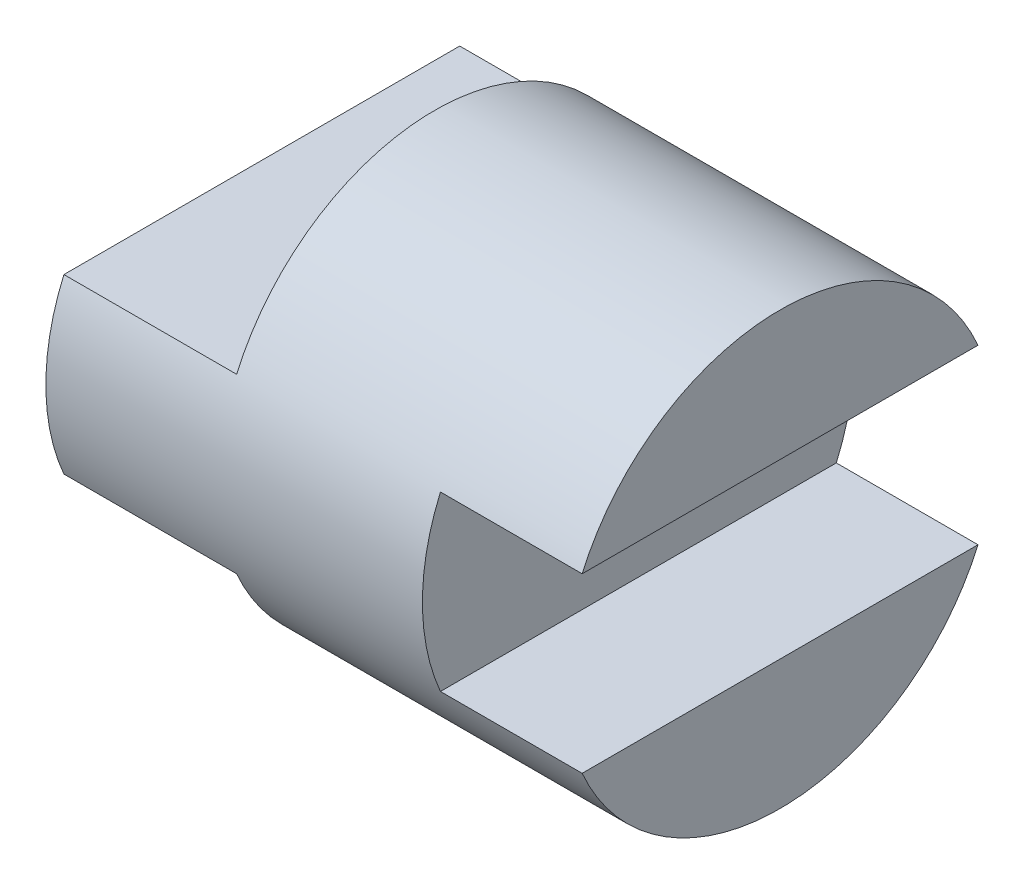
ISO-10303-21;
HEADER;
FILE_DESCRIPTION(('STEP AP214'),'2;1');
FILE_NAME('part.step','',(''),(''),'','','');
FILE_SCHEMA(('AUTOMOTIVE_DESIGN { 1 0 10303 214 1 1 1 1 }'));
ENDSEC;
DATA;
#1=APPLICATION_CONTEXT('core data for automotive mechanical design processes');
#2=APPLICATION_PROTOCOL_DEFINITION('international standard','automotive_design',2000,#1);
#3=PRODUCT_CONTEXT('',#1,'mechanical');
#4=PRODUCT('Part','Part','',(#3));
#5=PRODUCT_RELATED_PRODUCT_CATEGORY('part','',(#4));
#6=PRODUCT_DEFINITION_FORMATION('','',#4);
#7=PRODUCT_DEFINITION_CONTEXT('part definition',#1,'design');
#8=PRODUCT_DEFINITION('design','',#6,#7);
#9=PRODUCT_DEFINITION_SHAPE('','',#8);
#10=(LENGTH_UNIT() NAMED_UNIT(*) SI_UNIT(.MILLI.,.METRE.));
#11=(NAMED_UNIT(*) PLANE_ANGLE_UNIT() SI_UNIT($,.RADIAN.));
#12=(NAMED_UNIT(*) SI_UNIT($,.STERADIAN.) SOLID_ANGLE_UNIT());
#13=UNCERTAINTY_MEASURE_WITH_UNIT(LENGTH_MEASURE(1.E-05),#10,'distance_accuracy_value','');
#14=(GEOMETRIC_REPRESENTATION_CONTEXT(3) GLOBAL_UNCERTAINTY_ASSIGNED_CONTEXT((#13)) GLOBAL_UNIT_ASSIGNED_CONTEXT((#10,
#11,#12)) REPRESENTATION_CONTEXT('',''));
#15=CARTESIAN_POINT('',(0.,0.,0.));
#16=DIRECTION('',(0.,0.,1.));
#17=DIRECTION('',(1.,0.,0.));
#18=AXIS2_PLACEMENT_3D('',#15,#16,#17);
#19=CARTESIAN_POINT('',(120.,0.,0.));
#20=DIRECTION('',(1.,0.,0.));
#21=DIRECTION('',(0.,0.,-1.));
#22=AXIS2_PLACEMENT_3D('',#19,#20,#21);
#23=PLANE('',#22);
#24=DIRECTION('',(0.,0.,-1.));
#25=VECTOR('',#24,1.);
#26=CARTESIAN_POINT('',(120.,-20.,0.));
#27=LINE('',#26,#25);
#28=CARTESIAN_POINT('',(120.,-20.,45.8257569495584));
#29=VERTEX_POINT('',#28);
#30=CARTESIAN_POINT('',(120.,-20.,-45.8257569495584));
#31=VERTEX_POINT('',#30);
#32=EDGE_CURVE('E154',#29,#31,#27,.T.);
#33=ORIENTED_EDGE('',*,*,#32,.F.);
#34=CARTESIAN_POINT('',(120.,0.,0.));
#35=DIRECTION('',(1.,0.,0.));
#36=DIRECTION('',(0.,0.,-1.));
#37=AXIS2_PLACEMENT_3D('',#34,#35,#36);
#38=CIRCLE('',#37,50.);
#39=EDGE_CURVE('E138',#29,#31,#38,.T.);
#40=ORIENTED_EDGE('',*,*,#39,.T.);
#41=EDGE_LOOP('',(#33,#40));
#42=FACE_BOUND('',#41,.T.);
#43=ADVANCED_FACE('F31',(#42),#23,.T.);
#44=CARTESIAN_POINT('',(120.,0.,0.));
#45=DIRECTION('',(-1.,0.,0.));
#46=DIRECTION('',(0.,0.,1.));
#47=AXIS2_PLACEMENT_3D('',#44,#45,#46);
#48=CYLINDRICAL_SURFACE('',#47,50.);
#49=DIRECTION('',(-1.,0.,0.));
#50=VECTOR('',#49,1.);
#51=CARTESIAN_POINT('',(120.,20.,-45.8257569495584));
#52=LINE('',#51,#50);
#53=CARTESIAN_POINT('',(120.,20.,-45.8257569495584));
#54=VERTEX_POINT('',#53);
#55=CARTESIAN_POINT('',(87.1908753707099,20.,-45.8257569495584));
#56=VERTEX_POINT('',#55);
#57=EDGE_CURVE('E46',#54,#56,#52,.T.);
#58=ORIENTED_EDGE('',*,*,#57,.T.);
#59=CARTESIAN_POINT('',(87.1908753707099,0.,0.));
#60=DIRECTION('',(-1.,0.,0.));
#61=DIRECTION('',(0.,0.,1.));
#62=AXIS2_PLACEMENT_3D('',#59,#60,#61);
#63=CIRCLE('',#62,50.);
#64=CARTESIAN_POINT('',(87.1908753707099,-20.,-45.8257569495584));
#65=VERTEX_POINT('',#64);
#66=EDGE_CURVE('E11',#56,#65,#63,.T.);
#67=ORIENTED_EDGE('',*,*,#66,.T.);
#68=DIRECTION('',(-1.,0.,0.));
#69=VECTOR('',#68,1.);
#70=CARTESIAN_POINT('',(120.,-20.,-45.8257569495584));
#71=LINE('',#70,#69);
#72=EDGE_CURVE('E113',#65,#31,#71,.F.);
#73=ORIENTED_EDGE('',*,*,#72,.T.);
#74=ORIENTED_EDGE('',*,*,#39,.F.);
#75=DIRECTION('',(-1.,0.,0.));
#76=VECTOR('',#75,1.);
#77=CARTESIAN_POINT('',(120.,-20.,45.8257569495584));
#78=LINE('',#77,#76);
#79=CARTESIAN_POINT('',(87.1908753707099,-20.,45.8257569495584));
#80=VERTEX_POINT('',#79);
#81=EDGE_CURVE('E115',#29,#80,#78,.T.);
#82=ORIENTED_EDGE('',*,*,#81,.T.);
#83=CARTESIAN_POINT('',(87.1908753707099,20.,45.8257569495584));
#84=VERTEX_POINT('',#83);
#85=EDGE_CURVE('E35',#80,#84,#63,.T.);
#86=ORIENTED_EDGE('',*,*,#85,.T.);
#87=DIRECTION('',(-1.,0.,0.));
#88=VECTOR('',#87,1.);
#89=CARTESIAN_POINT('',(120.,20.,45.8257569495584));
#90=LINE('',#89,#88);
#91=CARTESIAN_POINT('',(120.,20.,45.8257569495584));
#92=VERTEX_POINT('',#91);
#93=EDGE_CURVE('E107',#84,#92,#90,.F.);
#94=ORIENTED_EDGE('',*,*,#93,.T.);
#95=EDGE_CURVE('E112',#54,#92,#38,.T.);
#96=ORIENTED_EDGE('',*,*,#95,.F.);
#97=EDGE_LOOP('',(#58,#67,#73,#74,#82,#86,#94,#96));
#98=FACE_BOUND('',#97,.T.);
#99=CARTESIAN_POINT('',(40.,0.,0.));
#100=DIRECTION('',(-1.,0.,0.));
#101=DIRECTION('',(0.,0.,1.));
#102=AXIS2_PLACEMENT_3D('',#99,#100,#101);
#103=CIRCLE('',#102,50.);
#104=CARTESIAN_POINT('',(40.,-20.,-45.8257569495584));
#105=VERTEX_POINT('',#104);
#106=CARTESIAN_POINT('',(40.,-20.,45.8257569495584));
#107=VERTEX_POINT('',#106);
#108=EDGE_CURVE('E151',#105,#107,#103,.T.);
#109=ORIENTED_EDGE('',*,*,#108,.F.);
#110=DIRECTION('',(-1.,0.,0.));
#111=VECTOR('',#110,1.);
#112=CARTESIAN_POINT('',(120.,-20.,-45.8257569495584));
#113=LINE('',#112,#111);
#114=CARTESIAN_POINT('',(0.,-20.,-45.8257569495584));
#115=VERTEX_POINT('',#114);
#116=EDGE_CURVE('E125',#105,#115,#113,.T.);
#117=ORIENTED_EDGE('',*,*,#116,.T.);
#118=CARTESIAN_POINT('',(0.,0.,0.));
#119=DIRECTION('',(1.,0.,0.));
#120=DIRECTION('',(0.,0.,-1.));
#121=AXIS2_PLACEMENT_3D('',#118,#119,#120);
#122=CIRCLE('',#121,50.);
#123=CARTESIAN_POINT('',(0.,20.,-45.8257569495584));
#124=VERTEX_POINT('',#123);
#125=EDGE_CURVE('E137',#115,#124,#122,.T.);
#126=ORIENTED_EDGE('',*,*,#125,.T.);
#127=DIRECTION('',(-1.,0.,0.));
#128=VECTOR('',#127,1.);
#129=CARTESIAN_POINT('',(120.,20.,-45.8257569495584));
#130=LINE('',#129,#128);
#131=CARTESIAN_POINT('',(40.,20.,-45.8257569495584));
#132=VERTEX_POINT('',#131);
#133=EDGE_CURVE('E131',#124,#132,#130,.F.);
#134=ORIENTED_EDGE('',*,*,#133,.T.);
#135=CARTESIAN_POINT('',(40.,0.,0.));
#136=DIRECTION('',(-1.,0.,0.));
#137=DIRECTION('',(0.,0.,1.));
#138=AXIS2_PLACEMENT_3D('',#135,#136,#137);
#139=CIRCLE('',#138,50.);
#140=CARTESIAN_POINT('',(40.,20.,45.8257569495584));
#141=VERTEX_POINT('',#140);
#142=EDGE_CURVE('E147',#141,#132,#139,.T.);
#143=ORIENTED_EDGE('',*,*,#142,.F.);
#144=DIRECTION('',(-1.,0.,0.));
#145=VECTOR('',#144,1.);
#146=CARTESIAN_POINT('',(120.,20.,45.8257569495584));
#147=LINE('',#146,#145);
#148=CARTESIAN_POINT('',(0.,20.,45.8257569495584));
#149=VERTEX_POINT('',#148);
#150=EDGE_CURVE('E134',#141,#149,#147,.T.);
#151=ORIENTED_EDGE('',*,*,#150,.T.);
#152=CARTESIAN_POINT('',(0.,-20.,45.8257569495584));
#153=VERTEX_POINT('',#152);
#154=EDGE_CURVE('E141',#149,#153,#122,.T.);
#155=ORIENTED_EDGE('',*,*,#154,.T.);
#156=DIRECTION('',(-1.,0.,0.));
#157=VECTOR('',#156,1.);
#158=CARTESIAN_POINT('',(120.,-20.,45.8257569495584));
#159=LINE('',#158,#157);
#160=EDGE_CURVE('E54',#153,#107,#159,.F.);
#161=ORIENTED_EDGE('',*,*,#160,.T.);
#162=EDGE_LOOP('',(#109,#117,#126,#134,#143,#151,#155,#161));
#163=FACE_BOUND('',#162,.T.);
#164=ADVANCED_FACE('F33',(#98,#163),#48,.T.);
#165=DIRECTION('',(0.,0.,1.));
#166=VECTOR('',#165,1.);
#167=CARTESIAN_POINT('',(120.,20.,0.));
#168=LINE('',#167,#166);
#169=EDGE_CURVE('E153',#54,#92,#168,.T.);
#170=ORIENTED_EDGE('',*,*,#169,.F.);
#171=ORIENTED_EDGE('',*,*,#95,.T.);
#172=EDGE_LOOP('',(#170,#171));
#173=FACE_BOUND('',#172,.T.);
#174=ADVANCED_FACE('F163',(#173),#23,.T.);
#175=CARTESIAN_POINT('',(0.,0.,0.));
#176=DIRECTION('',(1.,0.,0.));
#177=DIRECTION('',(0.,0.,-1.));
#178=AXIS2_PLACEMENT_3D('',#175,#176,#177);
#179=PLANE('',#178);
#180=ORIENTED_EDGE('',*,*,#125,.F.);
#181=DIRECTION('',(0.,0.,1.));
#182=VECTOR('',#181,1.);
#183=CARTESIAN_POINT('',(0.,-20.,0.));
#184=LINE('',#183,#182);
#185=EDGE_CURVE('E149',#115,#153,#184,.T.);
#186=ORIENTED_EDGE('',*,*,#185,.T.);
#187=ORIENTED_EDGE('',*,*,#154,.F.);
#188=DIRECTION('',(0.,0.,-1.));
#189=VECTOR('',#188,1.);
#190=CARTESIAN_POINT('',(0.,20.,0.));
#191=LINE('',#190,#189);
#192=EDGE_CURVE('E144',#149,#124,#191,.T.);
#193=ORIENTED_EDGE('',*,*,#192,.T.);
#194=EDGE_LOOP('',(#180,#186,#187,#193));
#195=FACE_BOUND('',#194,.T.);
#196=ADVANCED_FACE('F169',(#195),#179,.F.);
#197=CARTESIAN_POINT('',(40.,20.,-58.2600856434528));
#198=DIRECTION('',(-1.,0.,0.));
#199=DIRECTION('',(0.,0.,1.));
#200=AXIS2_PLACEMENT_3D('',#197,#198,#199);
#201=PLANE('',#200);
#202=ORIENTED_EDGE('',*,*,#142,.T.);
#203=DIRECTION('',(0.,0.,1.));
#204=VECTOR('',#203,1.);
#205=CARTESIAN_POINT('',(40.,20.,-58.2600856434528));
#206=LINE('',#205,#204);
#207=EDGE_CURVE('E128',#132,#141,#206,.T.);
#208=ORIENTED_EDGE('',*,*,#207,.T.);
#209=EDGE_LOOP('',(#202,#208));
#210=FACE_BOUND('',#209,.T.);
#211=ADVANCED_FACE('F174',(#210),#201,.T.);
#212=CARTESIAN_POINT('',(40.,20.,-58.2600856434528));
#213=DIRECTION('',(0.,-1.,0.));
#214=DIRECTION('',(0.,0.,-1.));
#215=AXIS2_PLACEMENT_3D('',#212,#213,#214);
#216=PLANE('',#215);
#217=ORIENTED_EDGE('',*,*,#207,.F.);
#218=ORIENTED_EDGE('',*,*,#133,.F.);
#219=ORIENTED_EDGE('',*,*,#192,.F.);
#220=ORIENTED_EDGE('',*,*,#150,.F.);
#221=EDGE_LOOP('',(#217,#218,#219,#220));
#222=FACE_BOUND('',#221,.T.);
#223=ADVANCED_FACE('F179',(#222),#216,.F.);
#224=CARTESIAN_POINT('',(40.,-52.8487716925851,52.8885883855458));
#225=DIRECTION('',(-1.,0.,0.));
#226=DIRECTION('',(0.,0.,1.));
#227=AXIS2_PLACEMENT_3D('',#224,#225,#226);
#228=PLANE('',#227);
#229=ORIENTED_EDGE('',*,*,#108,.T.);
#230=DIRECTION('',(0.,0.,-1.));
#231=VECTOR('',#230,1.);
#232=CARTESIAN_POINT('',(40.,-20.,-58.2600856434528));
#233=LINE('',#232,#231);
#234=EDGE_CURVE('E121',#107,#105,#233,.T.);
#235=ORIENTED_EDGE('',*,*,#234,.T.);
#236=EDGE_LOOP('',(#229,#235));
#237=FACE_BOUND('',#236,.T.);
#238=ADVANCED_FACE('F190',(#237),#228,.T.);
#239=CARTESIAN_POINT('',(40.,-20.,-58.2600856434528));
#240=DIRECTION('',(0.,1.,0.));
#241=DIRECTION('',(0.,0.,1.));
#242=AXIS2_PLACEMENT_3D('',#239,#240,#241);
#243=PLANE('',#242);
#244=ORIENTED_EDGE('',*,*,#234,.F.);
#245=ORIENTED_EDGE('',*,*,#160,.F.);
#246=ORIENTED_EDGE('',*,*,#185,.F.);
#247=ORIENTED_EDGE('',*,*,#116,.F.);
#248=EDGE_LOOP('',(#244,#245,#246,#247));
#249=FACE_BOUND('',#248,.T.);
#250=ADVANCED_FACE('F191',(#249),#243,.F.);
#251=CARTESIAN_POINT('',(87.1908753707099,20.,-50.));
#252=DIRECTION('',(-1.,0.,0.));
#253=DIRECTION('',(0.,0.,1.));
#254=AXIS2_PLACEMENT_3D('',#251,#252,#253);
#255=PLANE('',#254);
#256=DIRECTION('',(0.,0.,1.));
#257=VECTOR('',#256,1.);
#258=CARTESIAN_POINT('',(87.1908753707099,20.,-50.));
#259=LINE('',#258,#257);
#260=EDGE_CURVE('E99',#56,#84,#259,.T.);
#261=ORIENTED_EDGE('',*,*,#260,.T.);
#262=ORIENTED_EDGE('',*,*,#85,.F.);
#263=DIRECTION('',(0.,0.,1.));
#264=VECTOR('',#263,1.);
#265=CARTESIAN_POINT('',(87.1908753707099,-20.,-50.));
#266=LINE('',#265,#264);
#267=EDGE_CURVE('E101',#65,#80,#266,.T.);
#268=ORIENTED_EDGE('',*,*,#267,.F.);
#269=ORIENTED_EDGE('',*,*,#66,.F.);
#270=EDGE_LOOP('',(#261,#262,#268,#269));
#271=FACE_BOUND('',#270,.T.);
#272=ADVANCED_FACE('F98',(#271),#255,.F.);
#273=CARTESIAN_POINT('',(160.7119378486,-20.,-50.));
#274=DIRECTION('',(0.,-1.,0.));
#275=DIRECTION('',(1.,0.,0.));
#276=AXIS2_PLACEMENT_3D('',#273,#274,#275);
#277=PLANE('',#276);
#278=ORIENTED_EDGE('',*,*,#32,.T.);
#279=ORIENTED_EDGE('',*,*,#72,.F.);
#280=ORIENTED_EDGE('',*,*,#267,.T.);
#281=ORIENTED_EDGE('',*,*,#81,.F.);
#282=EDGE_LOOP('',(#278,#279,#280,#281));
#283=FACE_BOUND('',#282,.T.);
#284=ADVANCED_FACE('F158',(#283),#277,.F.);
#285=CARTESIAN_POINT('',(160.7119378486,20.,-50.));
#286=DIRECTION('',(0.,1.,0.));
#287=DIRECTION('',(-1.,0.,0.));
#288=AXIS2_PLACEMENT_3D('',#285,#286,#287);
#289=PLANE('',#288);
#290=ORIENTED_EDGE('',*,*,#169,.T.);
#291=ORIENTED_EDGE('',*,*,#93,.F.);
#292=ORIENTED_EDGE('',*,*,#260,.F.);
#293=ORIENTED_EDGE('',*,*,#57,.F.);
#294=EDGE_LOOP('',(#290,#291,#292,#293));
#295=FACE_BOUND('',#294,.T.);
#296=ADVANCED_FACE('F105',(#295),#289,.F.);
#297=CLOSED_SHELL('',(#43,#164,#174,#196,#211,#223,#238,#250,#272,#284,#296));
#298=MANIFOLD_SOLID_BREP('B2',#297);
#299=ADVANCED_BREP_SHAPE_REPRESENTATION('',(#18,#298),#14);
#300=SHAPE_DEFINITION_REPRESENTATION(#9,#299);
ENDSEC;
END-ISO-10303-21;
